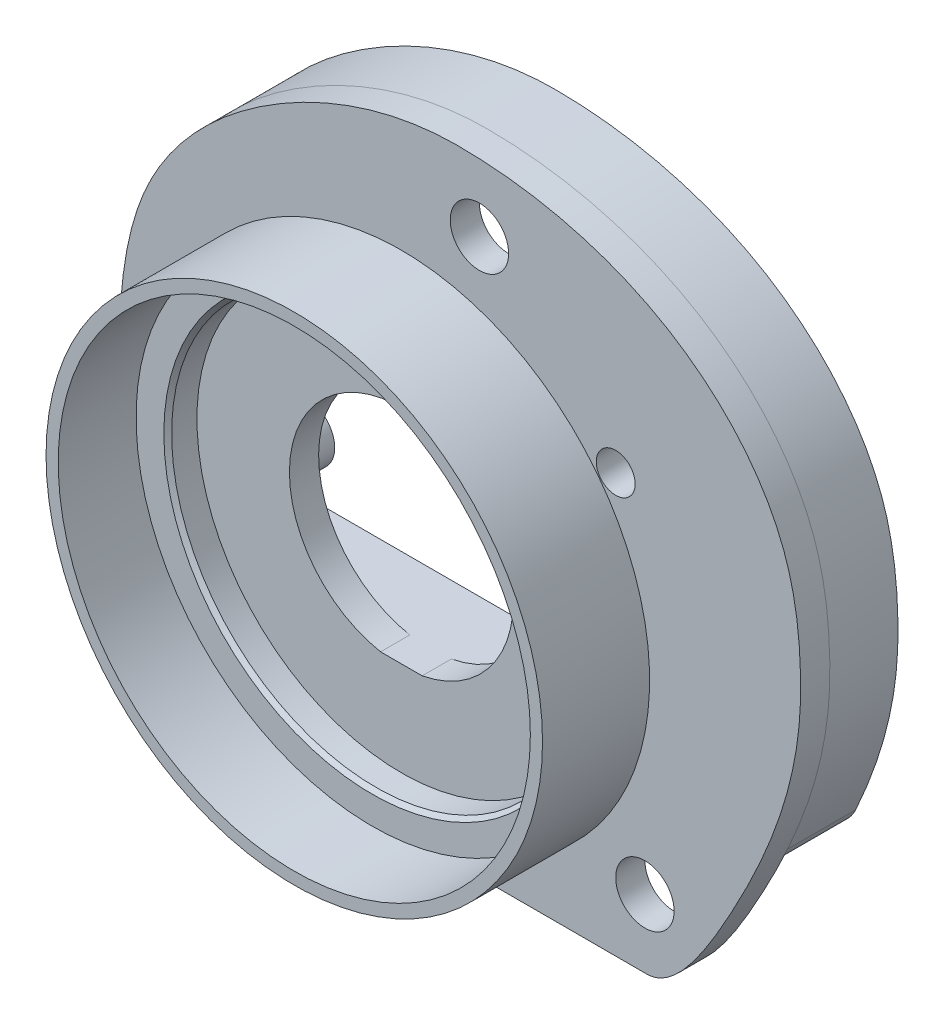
ISO-10303-21;
HEADER;
FILE_DESCRIPTION(('STEP AP214'),'2;1');
FILE_NAME('part.step','',(''),(''),'','','');
FILE_SCHEMA(('AUTOMOTIVE_DESIGN { 1 0 10303 214 1 1 1 1 }'));
ENDSEC;
DATA;
#1=APPLICATION_CONTEXT('core data for automotive mechanical design processes');
#2=APPLICATION_PROTOCOL_DEFINITION('international standard','automotive_design',2000,#1);
#3=PRODUCT_CONTEXT('',#1,'mechanical');
#4=PRODUCT('Part','Part','',(#3));
#5=PRODUCT_RELATED_PRODUCT_CATEGORY('part','',(#4));
#6=PRODUCT_DEFINITION_FORMATION('','',#4);
#7=PRODUCT_DEFINITION_CONTEXT('part definition',#1,'design');
#8=PRODUCT_DEFINITION('design','',#6,#7);
#9=PRODUCT_DEFINITION_SHAPE('','',#8);
#10=(LENGTH_UNIT() NAMED_UNIT(*) SI_UNIT(.MILLI.,.METRE.));
#11=(NAMED_UNIT(*) PLANE_ANGLE_UNIT() SI_UNIT($,.RADIAN.));
#12=(NAMED_UNIT(*) SI_UNIT($,.STERADIAN.) SOLID_ANGLE_UNIT());
#13=UNCERTAINTY_MEASURE_WITH_UNIT(LENGTH_MEASURE(1.E-05),#10,'distance_accuracy_value','');
#14=(GEOMETRIC_REPRESENTATION_CONTEXT(3) GLOBAL_UNCERTAINTY_ASSIGNED_CONTEXT((#13)) GLOBAL_UNIT_ASSIGNED_CONTEXT((#10,
#11,#12)) REPRESENTATION_CONTEXT('',''));
#15=CARTESIAN_POINT('',(0.,0.,0.));
#16=DIRECTION('',(0.,0.,1.));
#17=DIRECTION('',(1.,0.,0.));
#18=AXIS2_PLACEMENT_3D('',#15,#16,#17);
#19=CARTESIAN_POINT('',(31.5820135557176,13.1254710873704,-1.5));
#20=DIRECTION('',(0.,0.,-1.));
#21=DIRECTION('',(-1.,0.,0.));
#22=AXIS2_PLACEMENT_3D('',#19,#20,#21);
#23=PLANE('',#22);
#24=CARTESIAN_POINT('',(6.22831243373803,16.8240717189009,-1.5));
#25=DIRECTION('',(0.,0.,-1.));
#26=DIRECTION('',(-1.,0.,0.));
#27=AXIS2_PLACEMENT_3D('',#24,#25,#26);
#28=CIRCLE('',#27,1.5);
#29=CARTESIAN_POINT('',(4.72831243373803,16.8240717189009,-1.5));
#30=VERTEX_POINT('',#29);
#31=EDGE_CURVE('E166',#30,#30,#28,.T.);
#32=ORIENTED_EDGE('',*,*,#31,.F.);
#33=EDGE_LOOP('',(#32));
#34=FACE_BOUND('',#33,.T.);
#35=CARTESIAN_POINT('',(27.0866305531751,6.62407171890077,-1.5));
#36=DIRECTION('',(0.,0.,-1.));
#37=DIRECTION('',(-1.,0.,0.));
#38=AXIS2_PLACEMENT_3D('',#35,#36,#37);
#39=CIRCLE('',#38,1.5);
#40=CARTESIAN_POINT('',(25.5866305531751,6.62407171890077,-1.5));
#41=VERTEX_POINT('',#40);
#42=EDGE_CURVE('E178',#41,#41,#39,.T.);
#43=ORIENTED_EDGE('',*,*,#42,.F.);
#44=EDGE_LOOP('',(#43));
#45=FACE_BOUND('',#44,.T.);
#46=CARTESIAN_POINT('',(0.0708187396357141,6.62407171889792,-1.5));
#47=DIRECTION('',(0.,0.,-1.));
#48=DIRECTION('',(-1.,0.,0.));
#49=AXIS2_PLACEMENT_3D('',#46,#47,#48);
#50=CIRCLE('',#49,1.5);
#51=CARTESIAN_POINT('',(-1.42918126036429,6.62407171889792,-1.5));
#52=VERTEX_POINT('',#51);
#53=EDGE_CURVE('E190',#52,#52,#50,.T.);
#54=ORIENTED_EDGE('',*,*,#53,.F.);
#55=EDGE_LOOP('',(#54));
#56=FACE_BOUND('',#55,.T.);
#57=CARTESIAN_POINT('',(11.0942655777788,10.4740717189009,-1.5));
#58=DIRECTION('',(0.,0.,-1.));
#59=DIRECTION('',(-1.,0.,0.));
#60=AXIS2_PLACEMENT_3D('',#57,#58,#59);
#61=CIRCLE('',#60,5.75);
#62=CARTESIAN_POINT('',(10.0265577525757,4.82407171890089,-1.5));
#63=VERTEX_POINT('',#62);
#64=CARTESIAN_POINT('',(12.1619734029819,4.8240717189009,-1.5));
#65=VERTEX_POINT('',#64);
#66=EDGE_CURVE('E213',#63,#65,#61,.T.);
#67=ORIENTED_EDGE('',*,*,#66,.F.);
#68=DIRECTION('',(1.,0.,0.));
#69=VECTOR('',#68,1.);
#70=CARTESIAN_POINT('',(14.1039624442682,4.8240717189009,-1.5));
#71=LINE('',#70,#69);
#72=CARTESIAN_POINT('',(-0.534966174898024,4.82407171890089,-1.5));
#73=VERTEX_POINT('',#72);
#74=EDGE_CURVE('E471',#73,#63,#71,.T.);
#75=ORIENTED_EDGE('',*,*,#74,.F.);
#76=CARTESIAN_POINT('',(-0.534966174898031,5.82407171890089,-1.5));
#77=DIRECTION('',(0.,0.,1.));
#78=DIRECTION('',(1.,0.,0.));
#79=AXIS2_PLACEMENT_3D('',#76,#77,#78);
#80=CIRCLE('',#79,0.999999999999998);
#81=CARTESIAN_POINT('',(-1.49450825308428,5.54250645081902,-1.5));
#82=VERTEX_POINT('',#81);
#83=EDGE_CURVE('E482',#73,#82,#80,.F.);
#84=ORIENTED_EDGE('',*,*,#83,.T.);
#85=CARTESIAN_POINT('',(-1.49450825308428,5.54250645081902,-1.5));
#86=CARTESIAN_POINT('',(-1.5953175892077,5.88605308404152,-1.5));
#87=CARTESIAN_POINT('',(-1.78764288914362,6.58789998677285,-1.5));
#88=CARTESIAN_POINT('',(-2.09094383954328,7.91766389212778,-1.5));
#89=CARTESIAN_POINT('',(-2.34407765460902,9.54222727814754,-1.5));
#90=CARTESIAN_POINT('',(-2.42239712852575,11.5317924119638,-1.5));
#91=CARTESIAN_POINT('',(-2.32309957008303,14.3980351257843,-1.5));
#92=CARTESIAN_POINT('',(-1.78209325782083,17.8582865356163,-1.5));
#93=CARTESIAN_POINT('',(0.0646065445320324,21.3932267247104,-1.5));
#94=CARTESIAN_POINT('',(3.05839520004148,24.3711127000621,-1.5));
#95=CARTESIAN_POINT('',(6.73487663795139,26.675611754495,-1.5));
#96=CARTESIAN_POINT('',(10.0542104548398,27.878785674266,-1.5));
#97=CARTESIAN_POINT('',(12.737228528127,28.3169879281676,-1.5));
#98=CARTESIAN_POINT('',(15.4205692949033,28.3515467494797,-1.5));
#99=CARTESIAN_POINT('',(18.9649524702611,27.9246297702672,-1.5));
#100=CARTESIAN_POINT('',(22.9874672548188,26.5786026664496,-1.5));
#101=CARTESIAN_POINT('',(26.5229410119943,24.3049221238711,-1.5));
#102=CARTESIAN_POINT('',(28.7679292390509,21.6523952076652,-1.5));
#103=CARTESIAN_POINT('',(29.9190852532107,19.2118556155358,-1.5));
#104=CARTESIAN_POINT('',(30.4118310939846,17.2008095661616,-1.5));
#105=CARTESIAN_POINT('',(30.5763357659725,15.4436026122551,-1.5));
#106=CARTESIAN_POINT('',(30.6094587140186,14.1080941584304,-1.5));
#107=CARTESIAN_POINT('',(30.5749402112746,12.2446341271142,-1.5));
#108=CARTESIAN_POINT('',(30.2229204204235,10.0606266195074,-1.5));
#109=CARTESIAN_POINT('',(29.4965053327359,7.78614003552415,-1.5));
#110=CARTESIAN_POINT('',(28.9750160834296,6.44924835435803,-1.5));
#111=CARTESIAN_POINT('',(28.6718382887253,5.75144658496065,-1.5));
#112=CARTESIAN_POINT('',(28.5166633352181,5.41016498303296,-1.5));
#113=B_SPLINE_CURVE_WITH_KNOTS('',3,(#85,#86,#87,#88,#89,#90,#91,#92,#93,#94,#95,#96,#97,#98,
#99,#100,#101,#102,#103,#104,#105,#106,#107,#108,#109,#110,#111,#112),.UNSPECIFIED.,.F.,.F.,(4,
1,1,1,1,1,1,1,1,1,1,1,1,1,1,1,1,1,1,1,1,1,1,1,1,4),(0.941741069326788,0.951709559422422,
0.961678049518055,0.981615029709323,1.00155200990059,1.02148899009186,1.0613629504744,
1.10123691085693,1.14111087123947,1.180984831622,1.22085879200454,1.24079577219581,
1.26073275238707,1.30060671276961,1.34048067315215,1.38035463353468,1.42022859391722,
1.44016557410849,1.46010255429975,1.48003953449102,1.49000802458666,1.49997651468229,
1.53985047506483,1.55978745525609,1.56975594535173,1.57972443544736),.UNSPECIFIED.);
#114=CARTESIAN_POINT('',(28.5166633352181,5.41016498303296,-1.5));
#115=VERTEX_POINT('',#114);
#116=EDGE_CURVE('E506',#115,#82,#113,.F.);
#117=ORIENTED_EDGE('',*,*,#116,.F.);
#118=CARTESIAN_POINT('',(27.6063440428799,5.8240717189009,-1.5));
#119=DIRECTION('',(0.,0.,1.));
#120=DIRECTION('',(1.,0.,0.));
#121=AXIS2_PLACEMENT_3D('',#118,#119,#120);
#122=CIRCLE('',#121,1.);
#123=CARTESIAN_POINT('',(27.6063440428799,4.8240717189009,-1.5));
#124=VERTEX_POINT('',#123);
#125=EDGE_CURVE('E223',#115,#124,#122,.F.);
#126=ORIENTED_EDGE('',*,*,#125,.T.);
#127=EDGE_CURVE('E479',#65,#124,#71,.T.);
#128=ORIENTED_EDGE('',*,*,#127,.F.);
#129=EDGE_LOOP('',(#67,#75,#84,#117,#126,#128));
#130=FACE_BOUND('',#129,.T.);
#131=CARTESIAN_POINT('',(15.1028203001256,25.8240717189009,-1.5));
#132=DIRECTION('',(0.,0.,1.));
#133=DIRECTION('',(1.,0.,0.));
#134=AXIS2_PLACEMENT_3D('',#131,#132,#133);
#135=CIRCLE('',#134,1.5);
#136=CARTESIAN_POINT('',(16.6028203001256,25.8240717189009,-1.5));
#137=VERTEX_POINT('',#136);
#138=EDGE_CURVE('E328',#137,#137,#135,.T.);
#139=ORIENTED_EDGE('',*,*,#138,.T.);
#140=EDGE_LOOP('',(#139));
#141=FACE_BOUND('',#140,.T.);
#142=CARTESIAN_POINT('',(8.47380962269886,25.3240717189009,-1.5));
#143=DIRECTION('',(0.,0.,-1.));
#144=DIRECTION('',(-1.,0.,0.));
#145=AXIS2_PLACEMENT_3D('',#142,#143,#144);
#146=CIRCLE('',#145,1.5);
#147=CARTESIAN_POINT('',(6.97380962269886,25.3240717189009,-1.5));
#148=VERTEX_POINT('',#147);
#149=EDGE_CURVE('E184',#148,#148,#146,.T.);
#150=ORIENTED_EDGE('',*,*,#149,.F.);
#151=EDGE_LOOP('',(#150));
#152=FACE_BOUND('',#151,.T.);
#153=CARTESIAN_POINT('',(14.1655663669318,17.8240717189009,-1.5));
#154=DIRECTION('',(0.,0.,-1.));
#155=DIRECTION('',(-1.,0.,0.));
#156=AXIS2_PLACEMENT_3D('',#153,#154,#155);
#157=CIRCLE('',#156,1.5);
#158=CARTESIAN_POINT('',(12.6655663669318,17.8240717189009,-1.5));
#159=VERTEX_POINT('',#158);
#160=EDGE_CURVE('E172',#159,#159,#157,.T.);
#161=ORIENTED_EDGE('',*,*,#160,.F.);
#162=EDGE_LOOP('',(#161));
#163=FACE_BOUND('',#162,.T.);
#164=CARTESIAN_POINT('',(22.1028203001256,18.8240717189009,-1.5));
#165=DIRECTION('',(0.,0.,-1.));
#166=DIRECTION('',(-1.,0.,0.));
#167=AXIS2_PLACEMENT_3D('',#164,#165,#166);
#168=CIRCLE('',#167,2.3);
#169=CARTESIAN_POINT('',(21.0228203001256,20.8547366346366,-1.5));
#170=VERTEX_POINT('',#169);
#171=CARTESIAN_POINT('',(21.0228203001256,16.7934068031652,-1.5));
#172=VERTEX_POINT('',#171);
#173=EDGE_CURVE('E42',#170,#172,#168,.T.);
#174=ORIENTED_EDGE('',*,*,#173,.F.);
#175=DIRECTION('',(-0.386940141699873,0.922104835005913,0.));
#176=VECTOR('',#175,1.);
#177=CARTESIAN_POINT('',(21.5307594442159,19.6442828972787,-1.5));
#178=LINE('',#177,#176);
#179=CARTESIAN_POINT('',(21.5307594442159,19.6442828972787,-1.5));
#180=VERTEX_POINT('',#179);
#181=EDGE_CURVE('E139',#180,#170,#178,.T.);
#182=ORIENTED_EDGE('',*,*,#181,.F.);
#183=CARTESIAN_POINT('',(22.1028203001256,18.8240717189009,-1.5));
#184=DIRECTION('',(0.,0.,1.));
#185=DIRECTION('',(1.,0.,0.));
#186=AXIS2_PLACEMENT_3D('',#183,#184,#185);
#187=CIRCLE('',#186,1.);
#188=CARTESIAN_POINT('',(21.8806508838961,17.8490636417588,-1.5));
#189=VERTEX_POINT('',#188);
#190=EDGE_CURVE('E127',#180,#189,#187,.T.);
#191=ORIENTED_EDGE('',*,*,#190,.T.);
#192=DIRECTION('',(-0.630641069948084,-0.776074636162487,0.));
#193=VECTOR('',#192,1.);
#194=CARTESIAN_POINT('',(21.8806508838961,17.8490636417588,-1.5));
#195=LINE('',#194,#193);
#196=EDGE_CURVE('E47',#189,#172,#195,.T.);
#197=ORIENTED_EDGE('',*,*,#196,.T.);
#198=EDGE_LOOP('',(#174,#182,#191,#197));
#199=FACE_BOUND('',#198,.T.);
#200=ADVANCED_FACE('F26',(#34,#45,#56,#130,#141,#152,#163,#199),#23,.T.);
#201=CARTESIAN_POINT('',(6.22831243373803,16.8240717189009,-2.));
#202=DIRECTION('',(0.,0.,-1.));
#203=DIRECTION('',(-1.,0.,0.));
#204=AXIS2_PLACEMENT_3D('',#201,#202,#203);
#205=PLANE('',#204);
#206=CARTESIAN_POINT('',(6.22831243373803,16.8240717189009,-2.));
#207=DIRECTION('',(0.,0.,-1.));
#208=DIRECTION('',(-1.,0.,0.));
#209=AXIS2_PLACEMENT_3D('',#206,#207,#208);
#210=CIRCLE('',#209,1.5);
#211=CARTESIAN_POINT('',(4.72831243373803,16.8240717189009,-2.));
#212=VERTEX_POINT('',#211);
#213=EDGE_CURVE('E169',#212,#212,#210,.T.);
#214=ORIENTED_EDGE('',*,*,#213,.T.);
#215=EDGE_LOOP('',(#214));
#216=FACE_BOUND('',#215,.T.);
#217=CARTESIAN_POINT('',(6.22831243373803,16.8240717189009,-2.));
#218=DIRECTION('',(0.,0.,-1.));
#219=DIRECTION('',(-1.,0.,0.));
#220=AXIS2_PLACEMENT_3D('',#217,#218,#219);
#221=CIRCLE('',#220,0.85);
#222=CARTESIAN_POINT('',(5.37831243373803,16.8240717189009,-2.));
#223=VERTEX_POINT('',#222);
#224=EDGE_CURVE('E161',#223,#223,#221,.F.);
#225=ORIENTED_EDGE('',*,*,#224,.T.);
#226=EDGE_LOOP('',(#225));
#227=FACE_BOUND('',#226,.T.);
#228=ADVANCED_FACE('F288',(#216,#227),#205,.T.);
#229=CARTESIAN_POINT('',(14.1655663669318,17.8240717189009,-3.7));
#230=DIRECTION('',(0.,0.,-1.));
#231=DIRECTION('',(-1.,0.,0.));
#232=AXIS2_PLACEMENT_3D('',#229,#230,#231);
#233=PLANE('',#232);
#234=CARTESIAN_POINT('',(14.1655663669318,17.8240717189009,-3.7));
#235=DIRECTION('',(0.,0.,-1.));
#236=DIRECTION('',(-1.,0.,0.));
#237=AXIS2_PLACEMENT_3D('',#234,#235,#236);
#238=CIRCLE('',#237,1.5);
#239=CARTESIAN_POINT('',(12.6655663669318,17.8240717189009,-3.7));
#240=VERTEX_POINT('',#239);
#241=EDGE_CURVE('E175',#240,#240,#238,.T.);
#242=ORIENTED_EDGE('',*,*,#241,.T.);
#243=EDGE_LOOP('',(#242));
#244=FACE_BOUND('',#243,.T.);
#245=CARTESIAN_POINT('',(14.1655663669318,17.8240717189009,-3.7));
#246=DIRECTION('',(0.,0.,-1.));
#247=DIRECTION('',(-1.,0.,0.));
#248=AXIS2_PLACEMENT_3D('',#245,#246,#247);
#249=CIRCLE('',#248,0.85);
#250=CARTESIAN_POINT('',(13.3155663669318,17.8240717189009,-3.7));
#251=VERTEX_POINT('',#250);
#252=EDGE_CURVE('E165',#251,#251,#249,.F.);
#253=ORIENTED_EDGE('',*,*,#252,.T.);
#254=EDGE_LOOP('',(#253));
#255=FACE_BOUND('',#254,.T.);
#256=ADVANCED_FACE('F294',(#244,#255),#233,.T.);
#257=CARTESIAN_POINT('',(31.5820135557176,13.1254710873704,0.));
#258=DIRECTION('',(0.,0.,-1.));
#259=DIRECTION('',(-1.,0.,0.));
#260=AXIS2_PLACEMENT_3D('',#257,#258,#259);
#261=PLANE('',#260);
#262=CARTESIAN_POINT('',(23.6028203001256,0.824071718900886,0.));
#263=DIRECTION('',(0.,0.,1.));
#264=DIRECTION('',(1.,0.,0.));
#265=AXIS2_PLACEMENT_3D('',#262,#263,#264);
#266=CIRCLE('',#265,1.5);
#267=CARTESIAN_POINT('',(25.1028203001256,0.824071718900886,0.));
#268=VERTEX_POINT('',#267);
#269=EDGE_CURVE('E317',#268,#268,#266,.T.);
#270=ORIENTED_EDGE('',*,*,#269,.F.);
#271=EDGE_LOOP('',(#270));
#272=FACE_BOUND('',#271,.T.);
#273=CARTESIAN_POINT('',(22.1028203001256,18.8240717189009,0.));
#274=DIRECTION('',(0.,0.,1.));
#275=DIRECTION('',(1.,0.,0.));
#276=AXIS2_PLACEMENT_3D('',#273,#274,#275);
#277=CIRCLE('',#276,1.);
#278=CARTESIAN_POINT('',(23.1028203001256,18.8240717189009,0.));
#279=VERTEX_POINT('',#278);
#280=EDGE_CURVE('E136',#279,#279,#277,.T.);
#281=ORIENTED_EDGE('',*,*,#280,.F.);
#282=EDGE_LOOP('',(#281));
#283=FACE_BOUND('',#282,.T.);
#284=CARTESIAN_POINT('',(15.1028203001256,25.8240717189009,0.));
#285=DIRECTION('',(0.,0.,1.));
#286=DIRECTION('',(1.,0.,0.));
#287=AXIS2_PLACEMENT_3D('',#284,#285,#286);
#288=CIRCLE('',#287,1.5);
#289=CARTESIAN_POINT('',(16.6028203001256,25.8240717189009,0.));
#290=VERTEX_POINT('',#289);
#291=EDGE_CURVE('E135',#290,#290,#288,.T.);
#292=ORIENTED_EDGE('',*,*,#291,.F.);
#293=EDGE_LOOP('',(#292));
#294=FACE_BOUND('',#293,.T.);
#295=CARTESIAN_POINT('',(-3.39717969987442,11.3940717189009,0.));
#296=CARTESIAN_POINT('',(-3.3955130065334,8.68662854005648,0.));
#297=CARTESIAN_POINT('',(-2.37048036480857,4.0551062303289,0.));
#298=CARTESIAN_POINT('',(0.543552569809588,-2.67910524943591,0.));
#299=CARTESIAN_POINT('',(9.44137784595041,-2.66737217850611,0.));
#300=CARTESIAN_POINT('',(18.8489862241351,-2.6673721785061,0.));
#301=CARTESIAN_POINT('',(25.1310998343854,-2.67846884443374,0.));
#302=CARTESIAN_POINT('',(29.7261899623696,4.57031544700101,0.));
#303=CARTESIAN_POINT('',(31.6067218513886,10.1134498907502,0.));
#304=CARTESIAN_POINT('',(31.6012560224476,15.5639673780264,0.));
#305=CARTESIAN_POINT('',(31.2272704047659,20.572792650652,0.));
#306=CARTESIAN_POINT('',(25.2670084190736,27.6598455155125,0.));
#307=CARTESIAN_POINT('',(17.9103775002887,29.3286394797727,0.));
#308=CARTESIAN_POINT('',(10.6728633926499,29.3202436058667,0.));
#309=CARTESIAN_POINT('',(4.09944910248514,27.0823658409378,0.));
#310=CARTESIAN_POINT('',(-2.8292419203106,20.1806584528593,0.));
#311=CARTESIAN_POINT('',(-3.39879696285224,14.0212182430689,0.));
#312=CARTESIAN_POINT('',(-3.39717969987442,11.3940717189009,0.));
#313=B_SPLINE_CURVE_WITH_KNOTS('',3,(#295,#296,#297,#298,#299,#300,#301,#302,#303,#304,#305,
#306,#307,#308,#309,#310,#311,#312),.UNSPECIFIED.,.T.,.F.,(4,1,2,2,1,2,1,1,2,1,1,4),(0.,
0.0750955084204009,0.145707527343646,0.335877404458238,0.392344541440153,0.508788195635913,
0.555474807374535,0.636980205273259,0.746884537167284,0.838992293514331,0.927131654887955,1.),.UNSPECIFIED.);
#314=CARTESIAN_POINT('',(-3.39717969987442,11.3940717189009,0.));
#315=VERTEX_POINT('',#314);
#316=EDGE_CURVE('E331',#315,#315,#313,.T.);
#317=ORIENTED_EDGE('',*,*,#316,.T.);
#318=EDGE_LOOP('',(#317));
#319=FACE_BOUND('',#318,.T.);
#320=CARTESIAN_POINT('',(11.0942655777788,10.4740717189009,0.));
#321=DIRECTION('',(0.,0.,-1.));
#322=DIRECTION('',(-1.,0.,0.));
#323=AXIS2_PLACEMENT_3D('',#320,#321,#322);
#324=CIRCLE('',#323,12.75);
#325=CARTESIAN_POINT('',(-1.65573442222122,10.4740717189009,0.));
#326=VERTEX_POINT('',#325);
#327=EDGE_CURVE('E257',#326,#326,#324,.F.);
#328=ORIENTED_EDGE('',*,*,#327,.F.);
#329=EDGE_LOOP('',(#328));
#330=FACE_BOUND('',#329,.T.);
#331=ADVANCED_FACE('F309',(#272,#283,#294,#319,#330),#261,.F.);
#332=CARTESIAN_POINT('',(-3.39717969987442,11.3940717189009,-1.5));
#333=CARTESIAN_POINT('',(-3.3955130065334,8.68662854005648,-1.5));
#334=CARTESIAN_POINT('',(-2.37048036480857,4.0551062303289,-1.5));
#335=CARTESIAN_POINT('',(0.543552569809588,-2.67910524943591,-1.5));
#336=CARTESIAN_POINT('',(9.44137784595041,-2.66737217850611,-1.5));
#337=CARTESIAN_POINT('',(18.8489862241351,-2.6673721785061,-1.5));
#338=CARTESIAN_POINT('',(25.1310998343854,-2.67846884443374,-1.5));
#339=CARTESIAN_POINT('',(29.7261899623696,4.57031544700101,-1.5));
#340=CARTESIAN_POINT('',(31.6067218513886,10.1134498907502,-1.5));
#341=CARTESIAN_POINT('',(31.6012560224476,15.5639673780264,-1.5));
#342=CARTESIAN_POINT('',(31.2272704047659,20.572792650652,-1.5));
#343=CARTESIAN_POINT('',(25.2670084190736,27.6598455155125,-1.5));
#344=CARTESIAN_POINT('',(17.9103775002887,29.3286394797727,-1.5));
#345=CARTESIAN_POINT('',(10.6728633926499,29.3202436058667,-1.5));
#346=CARTESIAN_POINT('',(4.09944910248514,27.0823658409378,-1.5));
#347=CARTESIAN_POINT('',(-2.8292419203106,20.1806584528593,-1.5));
#348=CARTESIAN_POINT('',(-3.39879696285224,14.0212182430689,-1.5));
#349=CARTESIAN_POINT('',(-3.39717969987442,11.3940717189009,-1.5));
#350=B_SPLINE_CURVE_WITH_KNOTS('',3,(#332,#333,#334,#335,#336,#337,#338,#339,#340,#341,#342,
#343,#344,#345,#346,#347,#348,#349),.UNSPECIFIED.,.T.,.F.,(4,1,2,2,1,2,1,1,2,1,1,4),(0.,
0.0750955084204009,0.145707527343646,0.335877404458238,0.392344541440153,0.508788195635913,
0.555474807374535,0.636980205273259,0.746884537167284,0.838992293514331,0.927131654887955,1.),.UNSPECIFIED.);
#351=DIRECTION('',(0.,0.,1.));
#352=VECTOR('',#351,1.);
#353=SURFACE_OF_LINEAR_EXTRUSION('',#350,#352);
#354=CARTESIAN_POINT('',(-2.45405033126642,5.26094118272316,-1.5));
#355=VERTEX_POINT('',#354);
#356=CARTESIAN_POINT('',(29.4269826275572,4.99625824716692,-1.5));
#357=VERTEX_POINT('',#356);
#358=EDGE_CURVE('E230',#355,#357,#350,.T.);
#359=ORIENTED_EDGE('',*,*,#358,.T.);
#360=CARTESIAN_POINT('',(-3.39717969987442,11.3940717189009,-1.5));
#361=CARTESIAN_POINT('',(-3.3955130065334,8.68662854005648,-1.5));
#362=CARTESIAN_POINT('',(-2.37048036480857,4.0551062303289,-1.5));
#363=CARTESIAN_POINT('',(0.543552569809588,-2.67910524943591,-1.5));
#364=CARTESIAN_POINT('',(9.44137784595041,-2.66737217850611,-1.5));
#365=CARTESIAN_POINT('',(18.8489862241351,-2.6673721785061,-1.5));
#366=CARTESIAN_POINT('',(25.1310998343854,-2.67846884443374,-1.5));
#367=CARTESIAN_POINT('',(29.7261899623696,4.57031544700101,-1.5));
#368=CARTESIAN_POINT('',(31.6067218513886,10.1134498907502,-1.5));
#369=CARTESIAN_POINT('',(31.6012560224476,15.5639673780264,-1.5));
#370=CARTESIAN_POINT('',(31.2272704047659,20.572792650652,-1.5));
#371=CARTESIAN_POINT('',(25.2670084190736,27.6598455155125,-1.5));
#372=CARTESIAN_POINT('',(17.9103775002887,29.3286394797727,-1.5));
#373=CARTESIAN_POINT('',(10.6728633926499,29.3202436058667,-1.5));
#374=CARTESIAN_POINT('',(4.09944910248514,27.0823658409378,-1.5));
#375=CARTESIAN_POINT('',(-2.8292419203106,20.1806584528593,-1.5));
#376=CARTESIAN_POINT('',(-3.39879696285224,14.0212182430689,-1.5));
#377=CARTESIAN_POINT('',(-3.39717969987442,11.3940717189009,-1.5));
#378=B_SPLINE_CURVE_WITH_KNOTS('',3,(#360,#361,#362,#363,#364,#365,#366,#367,#368,#369,#370,
#371,#372,#373,#374,#375,#376,#377),.UNSPECIFIED.,.T.,.F.,(4,1,2,2,1,2,1,1,2,1,1,4),(0.,
0.0750955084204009,0.145707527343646,0.335877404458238,0.392344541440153,0.508788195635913,
0.555474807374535,0.636980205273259,0.746884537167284,0.838992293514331,0.927131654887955,1.),.UNSPECIFIED.);
#379=EDGE_CURVE('E229',#355,#357,#378,.F.);
#380=ORIENTED_EDGE('',*,*,#379,.F.);
#381=EDGE_LOOP('',(#359,#380));
#382=FACE_BOUND('',#381,.T.);
#383=ORIENTED_EDGE('',*,*,#316,.F.);
#384=EDGE_LOOP('',(#383));
#385=FACE_BOUND('',#384,.T.);
#386=ADVANCED_FACE('F28',(#382,#385),#353,.T.);
#387=CARTESIAN_POINT('',(27.6063440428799,5.8240717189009,-1.5));
#388=DIRECTION('',(0.,0.,1.));
#389=DIRECTION('',(1.,0.,0.));
#390=AXIS2_PLACEMENT_3D('',#387,#388,#389);
#391=CIRCLE('',#390,2.);
#392=CARTESIAN_POINT('',(27.6063440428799,3.82407171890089,-1.5));
#393=VERTEX_POINT('',#392);
#394=EDGE_CURVE('E240',#357,#393,#391,.F.);
#395=ORIENTED_EDGE('',*,*,#394,.F.);
#396=ORIENTED_EDGE('',*,*,#358,.F.);
#397=CARTESIAN_POINT('',(-0.534966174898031,5.82407171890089,-1.5));
#398=DIRECTION('',(0.,0.,1.));
#399=DIRECTION('',(1.,0.,0.));
#400=AXIS2_PLACEMENT_3D('',#397,#398,#399);
#401=CIRCLE('',#400,2.);
#402=CARTESIAN_POINT('',(-0.534966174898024,3.82407171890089,-1.5));
#403=VERTEX_POINT('',#402);
#404=EDGE_CURVE('E220',#403,#355,#401,.F.);
#405=ORIENTED_EDGE('',*,*,#404,.F.);
#406=DIRECTION('',(1.,0.,0.));
#407=VECTOR('',#406,1.);
#408=CARTESIAN_POINT('',(14.1039624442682,3.82407171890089,-1.5));
#409=LINE('',#408,#407);
#410=EDGE_CURVE('E218',#403,#393,#409,.T.);
#411=ORIENTED_EDGE('',*,*,#410,.T.);
#412=EDGE_LOOP('',(#395,#396,#405,#411));
#413=FACE_BOUND('',#412,.T.);
#414=CARTESIAN_POINT('',(23.6028203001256,0.824071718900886,-1.5));
#415=DIRECTION('',(0.,0.,1.));
#416=DIRECTION('',(1.,0.,0.));
#417=AXIS2_PLACEMENT_3D('',#414,#415,#416);
#418=CIRCLE('',#417,1.5);
#419=CARTESIAN_POINT('',(25.1028203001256,0.824071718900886,-1.5));
#420=VERTEX_POINT('',#419);
#421=EDGE_CURVE('E315',#420,#420,#418,.T.);
#422=ORIENTED_EDGE('',*,*,#421,.T.);
#423=EDGE_LOOP('',(#422));
#424=FACE_BOUND('',#423,.T.);
#425=ADVANCED_FACE('F290',(#413,#424),#23,.T.);
#426=CARTESIAN_POINT('',(11.0942655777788,10.4740717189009,0.));
#427=DIRECTION('',(0.,0.,1.));
#428=DIRECTION('',(1.,0.,0.));
#429=AXIS2_PLACEMENT_3D('',#426,#427,#428);
#430=CIRCLE('',#429,10.5);
#431=CARTESIAN_POINT('',(21.5942655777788,10.4740717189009,0.));
#432=VERTEX_POINT('',#431);
#433=EDGE_CURVE('E202',#432,#432,#430,.T.);
#434=ORIENTED_EDGE('',*,*,#433,.T.);
#435=EDGE_LOOP('',(#434));
#436=FACE_BOUND('',#435,.T.);
#437=DIRECTION('',(1.,0.,0.));
#438=VECTOR('',#437,1.);
#439=CARTESIAN_POINT('',(12.1619734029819,4.8240717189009,0.));
#440=LINE('',#439,#438);
#441=CARTESIAN_POINT('',(10.0265577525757,4.8240717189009,0.));
#442=VERTEX_POINT('',#441);
#443=CARTESIAN_POINT('',(12.1619734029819,4.8240717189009,0.));
#444=VERTEX_POINT('',#443);
#445=EDGE_CURVE('E207',#442,#444,#440,.T.);
#446=ORIENTED_EDGE('',*,*,#445,.F.);
#447=CARTESIAN_POINT('',(11.0942655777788,10.4740717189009,0.));
#448=DIRECTION('',(0.,0.,1.));
#449=DIRECTION('',(1.,0.,0.));
#450=AXIS2_PLACEMENT_3D('',#447,#448,#449);
#451=CIRCLE('',#450,5.75);
#452=EDGE_CURVE('E205',#444,#442,#451,.T.);
#453=ORIENTED_EDGE('',*,*,#452,.F.);
#454=EDGE_LOOP('',(#446,#453));
#455=FACE_BOUND('',#454,.T.);
#456=ADVANCED_FACE('F301',(#436,#455),#261,.F.);
#457=CARTESIAN_POINT('',(15.1028203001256,25.8240717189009,-1.5));
#458=DIRECTION('',(0.,0.,1.));
#459=DIRECTION('',(1.,0.,0.));
#460=AXIS2_PLACEMENT_3D('',#457,#458,#459);
#461=CYLINDRICAL_SURFACE('',#460,1.5);
#462=ORIENTED_EDGE('',*,*,#138,.F.);
#463=EDGE_LOOP('',(#462));
#464=FACE_BOUND('',#463,.T.);
#465=ORIENTED_EDGE('',*,*,#291,.T.);
#466=EDGE_LOOP('',(#465));
#467=FACE_BOUND('',#466,.T.);
#468=ADVANCED_FACE('F307',(#464,#467),#461,.F.);
#469=CARTESIAN_POINT('',(22.1028203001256,18.8240717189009,-1.5));
#470=DIRECTION('',(0.,0.,1.));
#471=DIRECTION('',(1.,0.,0.));
#472=AXIS2_PLACEMENT_3D('',#469,#470,#471);
#473=CYLINDRICAL_SURFACE('',#472,1.);
#474=ORIENTED_EDGE('',*,*,#190,.F.);
#475=DIRECTION('',(0.,0.,1.));
#476=VECTOR('',#475,1.);
#477=CARTESIAN_POINT('',(21.5307594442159,19.6442828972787,-5.5));
#478=LINE('',#477,#476);
#479=CARTESIAN_POINT('',(21.5307594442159,19.6442828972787,-5.5));
#480=VERTEX_POINT('',#479);
#481=EDGE_CURVE('E132',#480,#180,#478,.T.);
#482=ORIENTED_EDGE('',*,*,#481,.F.);
#483=CARTESIAN_POINT('',(22.1028203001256,18.8240717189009,-5.5));
#484=DIRECTION('',(0.,0.,-1.));
#485=DIRECTION('',(-1.,0.,0.));
#486=AXIS2_PLACEMENT_3D('',#483,#484,#485);
#487=CIRCLE('',#486,1.);
#488=CARTESIAN_POINT('',(21.8806508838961,17.8490636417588,-5.5));
#489=VERTEX_POINT('',#488);
#490=EDGE_CURVE('E147',#480,#489,#487,.T.);
#491=ORIENTED_EDGE('',*,*,#490,.T.);
#492=DIRECTION('',(0.,0.,1.));
#493=VECTOR('',#492,1.);
#494=CARTESIAN_POINT('',(21.8806508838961,17.8490636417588,-5.5));
#495=LINE('',#494,#493);
#496=EDGE_CURVE('E134',#489,#189,#495,.T.);
#497=ORIENTED_EDGE('',*,*,#496,.T.);
#498=EDGE_LOOP('',(#474,#482,#491,#497));
#499=FACE_BOUND('',#498,.T.);
#500=ORIENTED_EDGE('',*,*,#280,.T.);
#501=EDGE_LOOP('',(#500));
#502=FACE_BOUND('',#501,.T.);
#503=ADVANCED_FACE('F128',(#499,#502),#473,.F.);
#504=CARTESIAN_POINT('',(23.6028203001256,0.824071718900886,-1.5));
#505=DIRECTION('',(0.,0.,1.));
#506=DIRECTION('',(1.,0.,0.));
#507=AXIS2_PLACEMENT_3D('',#504,#505,#506);
#508=CYLINDRICAL_SURFACE('',#507,1.5);
#509=ORIENTED_EDGE('',*,*,#421,.F.);
#510=EDGE_LOOP('',(#509));
#511=FACE_BOUND('',#510,.T.);
#512=ORIENTED_EDGE('',*,*,#269,.T.);
#513=EDGE_LOOP('',(#512));
#514=FACE_BOUND('',#513,.T.);
#515=ADVANCED_FACE('F396',(#511,#514),#508,.F.);
#516=CARTESIAN_POINT('',(27.6063440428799,5.8240717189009,-5.));
#517=DIRECTION('',(0.,0.,1.));
#518=DIRECTION('',(1.,0.,0.));
#519=AXIS2_PLACEMENT_3D('',#516,#517,#518);
#520=CYLINDRICAL_SURFACE('',#519,1.);
#521=ORIENTED_EDGE('',*,*,#125,.F.);
#522=DIRECTION('',(0.,0.,1.));
#523=VECTOR('',#522,1.);
#524=CARTESIAN_POINT('',(28.5166633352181,5.41016498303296,-5.));
#525=LINE('',#524,#523);
#526=CARTESIAN_POINT('',(28.5166633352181,5.41016498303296,-5.));
#527=VERTEX_POINT('',#526);
#528=EDGE_CURVE('E322',#527,#115,#525,.T.);
#529=ORIENTED_EDGE('',*,*,#528,.F.);
#530=CARTESIAN_POINT('',(27.6063440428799,5.8240717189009,-5.));
#531=DIRECTION('',(0.,0.,1.));
#532=DIRECTION('',(1.,0.,0.));
#533=AXIS2_PLACEMENT_3D('',#530,#531,#532);
#534=CIRCLE('',#533,1.);
#535=CARTESIAN_POINT('',(27.6063440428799,4.8240717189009,-5.));
#536=VERTEX_POINT('',#535);
#537=EDGE_CURVE('E363',#527,#536,#534,.F.);
#538=ORIENTED_EDGE('',*,*,#537,.T.);
#539=DIRECTION('',(0.,0.,1.));
#540=VECTOR('',#539,1.);
#541=CARTESIAN_POINT('',(27.6063440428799,4.8240717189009,-5.));
#542=LINE('',#541,#540);
#543=EDGE_CURVE('E492',#536,#124,#542,.T.);
#544=ORIENTED_EDGE('',*,*,#543,.T.);
#545=EDGE_LOOP('',(#521,#529,#538,#544));
#546=FACE_BOUND('',#545,.T.);
#547=ADVANCED_FACE('F391',(#546),#520,.F.);
#548=CARTESIAN_POINT('',(-1.49450825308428,5.54250645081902,-5.));
#549=CARTESIAN_POINT('',(-1.5953175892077,5.88605308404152,-5.));
#550=CARTESIAN_POINT('',(-1.78764288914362,6.58789998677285,-5.));
#551=CARTESIAN_POINT('',(-2.09094383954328,7.91766389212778,-5.));
#552=CARTESIAN_POINT('',(-2.34407765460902,9.54222727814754,-5.));
#553=CARTESIAN_POINT('',(-2.42239712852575,11.5317924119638,-5.));
#554=CARTESIAN_POINT('',(-2.32309957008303,14.3980351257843,-5.));
#555=CARTESIAN_POINT('',(-1.78209325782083,17.8582865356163,-5.));
#556=CARTESIAN_POINT('',(0.0646065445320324,21.3932267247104,-5.));
#557=CARTESIAN_POINT('',(3.05839520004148,24.3711127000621,-5.));
#558=CARTESIAN_POINT('',(6.73487663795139,26.675611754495,-5.));
#559=CARTESIAN_POINT('',(10.0542104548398,27.878785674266,-5.));
#560=CARTESIAN_POINT('',(12.737228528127,28.3169879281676,-5.));
#561=CARTESIAN_POINT('',(15.4205692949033,28.3515467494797,-5.));
#562=CARTESIAN_POINT('',(18.9649524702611,27.9246297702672,-5.));
#563=CARTESIAN_POINT('',(22.9874672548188,26.5786026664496,-5.));
#564=CARTESIAN_POINT('',(26.5229410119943,24.3049221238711,-5.));
#565=CARTESIAN_POINT('',(28.7679292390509,21.6523952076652,-5.));
#566=CARTESIAN_POINT('',(29.9190852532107,19.2118556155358,-5.));
#567=CARTESIAN_POINT('',(30.4118310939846,17.2008095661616,-5.));
#568=CARTESIAN_POINT('',(30.5763357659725,15.4436026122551,-5.));
#569=CARTESIAN_POINT('',(30.6094587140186,14.1080941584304,-5.));
#570=CARTESIAN_POINT('',(30.5749402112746,12.2446341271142,-5.));
#571=CARTESIAN_POINT('',(30.2229204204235,10.0606266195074,-5.));
#572=CARTESIAN_POINT('',(29.4965053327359,7.78614003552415,-5.));
#573=CARTESIAN_POINT('',(28.9750160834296,6.44924835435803,-5.));
#574=CARTESIAN_POINT('',(28.6718382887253,5.75144658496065,-5.));
#575=CARTESIAN_POINT('',(28.5166633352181,5.41016498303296,-5.));
#576=B_SPLINE_CURVE_WITH_KNOTS('',3,(#548,#549,#550,#551,#552,#553,#554,#555,#556,#557,#558,
#559,#560,#561,#562,#563,#564,#565,#566,#567,#568,#569,#570,#571,#572,#573,#574,#575),
.UNSPECIFIED.,.F.,.F.,(4,1,1,1,1,1,1,1,1,1,1,1,1,1,1,1,1,1,1,1,1,1,1,1,1,4),(0.941741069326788,
0.951709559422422,0.961678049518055,0.981615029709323,1.00155200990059,1.02148899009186,
1.0613629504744,1.10123691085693,1.14111087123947,1.180984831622,1.22085879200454,
1.24079577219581,1.26073275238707,1.30060671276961,1.34048067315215,1.38035463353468,
1.42022859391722,1.44016557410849,1.46010255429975,1.48003953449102,1.49000802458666,
1.49997651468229,1.53985047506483,1.55978745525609,1.56975594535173,1.57972443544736),.UNSPECIFIED.);
#577=DIRECTION('',(0.,0.,1.));
#578=VECTOR('',#577,1.);
#579=SURFACE_OF_LINEAR_EXTRUSION('',#576,#578);
#580=ORIENTED_EDGE('',*,*,#116,.T.);
#581=DIRECTION('',(0.,0.,1.));
#582=VECTOR('',#581,1.);
#583=CARTESIAN_POINT('',(-1.49450825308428,5.54250645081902,-5.));
#584=LINE('',#583,#582);
#585=CARTESIAN_POINT('',(-1.49450825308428,5.54250645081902,-5.));
#586=VERTEX_POINT('',#585);
#587=EDGE_CURVE('E497',#586,#82,#584,.T.);
#588=ORIENTED_EDGE('',*,*,#587,.F.);
#589=EDGE_CURVE('E367',#527,#586,#576,.F.);
#590=ORIENTED_EDGE('',*,*,#589,.F.);
#591=ORIENTED_EDGE('',*,*,#528,.T.);
#592=EDGE_LOOP('',(#580,#588,#590,#591));
#593=FACE_BOUND('',#592,.T.);
#594=ADVANCED_FACE('F386',(#593),#579,.T.);
#595=CARTESIAN_POINT('',(-0.534966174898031,5.82407171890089,-5.));
#596=DIRECTION('',(0.,0.,1.));
#597=DIRECTION('',(1.,0.,0.));
#598=AXIS2_PLACEMENT_3D('',#595,#596,#597);
#599=CYLINDRICAL_SURFACE('',#598,0.999999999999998);
#600=ORIENTED_EDGE('',*,*,#83,.F.);
#601=DIRECTION('',(0.,0.,1.));
#602=VECTOR('',#601,1.);
#603=CARTESIAN_POINT('',(-0.534966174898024,4.82407171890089,-5.));
#604=LINE('',#603,#602);
#605=CARTESIAN_POINT('',(-0.534966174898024,4.82407171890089,-5.));
#606=VERTEX_POINT('',#605);
#607=EDGE_CURVE('E474',#606,#73,#604,.T.);
#608=ORIENTED_EDGE('',*,*,#607,.F.);
#609=CARTESIAN_POINT('',(-0.534966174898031,5.82407171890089,-5.));
#610=DIRECTION('',(0.,0.,1.));
#611=DIRECTION('',(1.,0.,0.));
#612=AXIS2_PLACEMENT_3D('',#609,#610,#611);
#613=CIRCLE('',#612,0.999999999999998);
#614=EDGE_CURVE('E380',#606,#586,#613,.F.);
#615=ORIENTED_EDGE('',*,*,#614,.T.);
#616=ORIENTED_EDGE('',*,*,#587,.T.);
#617=EDGE_LOOP('',(#600,#608,#615,#616));
#618=FACE_BOUND('',#617,.T.);
#619=ADVANCED_FACE('F390',(#618),#599,.F.);
#620=CARTESIAN_POINT('',(14.1039624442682,3.82407171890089,-5.));
#621=DIRECTION('',(0.,-1.,0.));
#622=DIRECTION('',(1.,0.,0.));
#623=AXIS2_PLACEMENT_3D('',#620,#621,#622);
#624=PLANE('',#623);
#625=ORIENTED_EDGE('',*,*,#410,.F.);
#626=DIRECTION('',(0.,0.,1.));
#627=VECTOR('',#626,1.);
#628=CARTESIAN_POINT('',(-0.534966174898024,3.82407171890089,-5.));
#629=LINE('',#628,#627);
#630=CARTESIAN_POINT('',(-0.534966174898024,3.82407171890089,-5.));
#631=VERTEX_POINT('',#630);
#632=EDGE_CURVE('E234',#631,#403,#629,.T.);
#633=ORIENTED_EDGE('',*,*,#632,.F.);
#634=DIRECTION('',(1.,0.,0.));
#635=VECTOR('',#634,1.);
#636=CARTESIAN_POINT('',(14.1039624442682,3.82407171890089,-5.));
#637=LINE('',#636,#635);
#638=CARTESIAN_POINT('',(27.6063440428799,3.82407171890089,-5.));
#639=VERTEX_POINT('',#638);
#640=EDGE_CURVE('E478',#631,#639,#637,.T.);
#641=ORIENTED_EDGE('',*,*,#640,.T.);
#642=DIRECTION('',(0.,0.,1.));
#643=VECTOR('',#642,1.);
#644=CARTESIAN_POINT('',(27.6063440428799,3.82407171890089,-5.));
#645=LINE('',#644,#643);
#646=EDGE_CURVE('E254',#639,#393,#645,.T.);
#647=ORIENTED_EDGE('',*,*,#646,.T.);
#648=EDGE_LOOP('',(#625,#633,#641,#647));
#649=FACE_BOUND('',#648,.T.);
#650=ADVANCED_FACE('F406',(#649),#624,.T.);
#651=CARTESIAN_POINT('',(-0.534966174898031,5.82407171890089,-5.));
#652=DIRECTION('',(0.,0.,1.));
#653=DIRECTION('',(1.,0.,0.));
#654=AXIS2_PLACEMENT_3D('',#651,#652,#653);
#655=CYLINDRICAL_SURFACE('',#654,2.);
#656=ORIENTED_EDGE('',*,*,#404,.T.);
#657=DIRECTION('',(0.,0.,1.));
#658=VECTOR('',#657,1.);
#659=CARTESIAN_POINT('',(-2.45405033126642,5.26094118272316,-5.));
#660=LINE('',#659,#658);
#661=CARTESIAN_POINT('',(-2.45405033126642,5.26094118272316,-5.));
#662=VERTEX_POINT('',#661);
#663=EDGE_CURVE('E231',#662,#355,#660,.T.);
#664=ORIENTED_EDGE('',*,*,#663,.F.);
#665=CARTESIAN_POINT('',(-0.534966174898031,5.82407171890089,-5.));
#666=DIRECTION('',(0.,0.,1.));
#667=DIRECTION('',(1.,0.,0.));
#668=AXIS2_PLACEMENT_3D('',#665,#666,#667);
#669=CIRCLE('',#668,2.);
#670=EDGE_CURVE('E369',#631,#662,#669,.F.);
#671=ORIENTED_EDGE('',*,*,#670,.F.);
#672=ORIENTED_EDGE('',*,*,#632,.T.);
#673=EDGE_LOOP('',(#656,#664,#671,#672));
#674=FACE_BOUND('',#673,.T.);
#675=ADVANCED_FACE('F403',(#674),#655,.T.);
#676=CARTESIAN_POINT('',(-3.39717969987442,11.3940717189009,-5.));
#677=CARTESIAN_POINT('',(-3.3955130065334,8.68662854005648,-5.));
#678=CARTESIAN_POINT('',(-2.37048036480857,4.0551062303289,-5.));
#679=CARTESIAN_POINT('',(0.543552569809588,-2.67910524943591,-5.));
#680=CARTESIAN_POINT('',(9.44137784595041,-2.66737217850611,-5.));
#681=CARTESIAN_POINT('',(18.8489862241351,-2.6673721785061,-5.));
#682=CARTESIAN_POINT('',(25.1310998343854,-2.67846884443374,-5.));
#683=CARTESIAN_POINT('',(29.7261899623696,4.57031544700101,-5.));
#684=CARTESIAN_POINT('',(31.6067218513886,10.1134498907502,-5.));
#685=CARTESIAN_POINT('',(31.6012560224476,15.5639673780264,-5.));
#686=CARTESIAN_POINT('',(31.2272704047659,20.572792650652,-5.));
#687=CARTESIAN_POINT('',(25.2670084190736,27.6598455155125,-5.));
#688=CARTESIAN_POINT('',(17.9103775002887,29.3286394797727,-5.));
#689=CARTESIAN_POINT('',(10.6728633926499,29.3202436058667,-5.));
#690=CARTESIAN_POINT('',(4.09944910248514,27.0823658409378,-5.));
#691=CARTESIAN_POINT('',(-2.8292419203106,20.1806584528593,-5.));
#692=CARTESIAN_POINT('',(-3.39879696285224,14.0212182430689,-5.));
#693=CARTESIAN_POINT('',(-3.39717969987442,11.3940717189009,-5.));
#694=B_SPLINE_CURVE_WITH_KNOTS('',3,(#676,#677,#678,#679,#680,#681,#682,#683,#684,#685,#686,
#687,#688,#689,#690,#691,#692,#693),.UNSPECIFIED.,.T.,.F.,(4,1,2,2,1,2,1,1,2,1,1,4),(0.,
0.0750955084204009,0.145707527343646,0.335877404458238,0.392344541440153,0.508788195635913,
0.555474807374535,0.636980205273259,0.746884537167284,0.838992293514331,0.927131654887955,1.),.UNSPECIFIED.);
#695=DIRECTION('',(0.,0.,1.));
#696=VECTOR('',#695,1.);
#697=SURFACE_OF_LINEAR_EXTRUSION('',#694,#696);
#698=ORIENTED_EDGE('',*,*,#379,.T.);
#699=DIRECTION('',(0.,0.,1.));
#700=VECTOR('',#699,1.);
#701=CARTESIAN_POINT('',(29.4269826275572,4.99625824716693,-5.));
#702=LINE('',#701,#700);
#703=CARTESIAN_POINT('',(29.4269826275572,4.99625824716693,-5.));
#704=VERTEX_POINT('',#703);
#705=EDGE_CURVE('E235',#704,#357,#702,.T.);
#706=ORIENTED_EDGE('',*,*,#705,.F.);
#707=EDGE_CURVE('E364',#662,#704,#694,.F.);
#708=ORIENTED_EDGE('',*,*,#707,.F.);
#709=ORIENTED_EDGE('',*,*,#663,.T.);
#710=EDGE_LOOP('',(#698,#706,#708,#709));
#711=FACE_BOUND('',#710,.T.);
#712=ADVANCED_FACE('F351',(#711),#697,.T.);
#713=CARTESIAN_POINT('',(27.6063440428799,5.8240717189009,-5.));
#714=DIRECTION('',(0.,0.,1.));
#715=DIRECTION('',(1.,0.,0.));
#716=AXIS2_PLACEMENT_3D('',#713,#714,#715);
#717=CYLINDRICAL_SURFACE('',#716,2.);
#718=ORIENTED_EDGE('',*,*,#394,.T.);
#719=ORIENTED_EDGE('',*,*,#646,.F.);
#720=CARTESIAN_POINT('',(27.6063440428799,5.8240717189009,-5.));
#721=DIRECTION('',(0.,0.,1.));
#722=DIRECTION('',(1.,0.,0.));
#723=AXIS2_PLACEMENT_3D('',#720,#721,#722);
#724=CIRCLE('',#723,2.);
#725=EDGE_CURVE('E358',#704,#639,#724,.F.);
#726=ORIENTED_EDGE('',*,*,#725,.F.);
#727=ORIENTED_EDGE('',*,*,#705,.T.);
#728=EDGE_LOOP('',(#718,#719,#726,#727));
#729=FACE_BOUND('',#728,.T.);
#730=ADVANCED_FACE('F356',(#729),#717,.T.);
#731=CARTESIAN_POINT('',(14.1039624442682,4.8240717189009,-5.));
#732=DIRECTION('',(0.,-1.,0.));
#733=DIRECTION('',(1.,0.,0.));
#734=AXIS2_PLACEMENT_3D('',#731,#732,#733);
#735=PLANE('',#734);
#736=ORIENTED_EDGE('',*,*,#74,.T.);
#737=DIRECTION('',(0.,0.,1.));
#738=VECTOR('',#737,1.);
#739=CARTESIAN_POINT('',(10.0265577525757,4.82407171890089,-3.5));
#740=LINE('',#739,#738);
#741=EDGE_CURVE('E210',#63,#442,#740,.T.);
#742=ORIENTED_EDGE('',*,*,#741,.T.);
#743=ORIENTED_EDGE('',*,*,#445,.T.);
#744=DIRECTION('',(0.,0.,1.));
#745=VECTOR('',#744,1.);
#746=CARTESIAN_POINT('',(12.1619734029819,4.8240717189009,-3.5));
#747=LINE('',#746,#745);
#748=EDGE_CURVE('E211',#65,#444,#747,.T.);
#749=ORIENTED_EDGE('',*,*,#748,.F.);
#750=ORIENTED_EDGE('',*,*,#127,.T.);
#751=ORIENTED_EDGE('',*,*,#543,.F.);
#752=DIRECTION('',(1.,0.,0.));
#753=VECTOR('',#752,1.);
#754=CARTESIAN_POINT('',(14.1039624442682,4.8240717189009,-5.));
#755=LINE('',#754,#753);
#756=EDGE_CURVE('E488',#606,#536,#755,.T.);
#757=ORIENTED_EDGE('',*,*,#756,.F.);
#758=ORIENTED_EDGE('',*,*,#607,.T.);
#759=EDGE_LOOP('',(#736,#742,#743,#749,#750,#751,#757,#758));
#760=FACE_BOUND('',#759,.T.);
#761=ADVANCED_FACE('F400',(#760),#735,.F.);
#762=CARTESIAN_POINT('',(14.1039624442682,-23.710808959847,-5.));
#763=DIRECTION('',(0.,0.,1.));
#764=DIRECTION('',(1.,0.,0.));
#765=AXIS2_PLACEMENT_3D('',#762,#763,#764);
#766=PLANE('',#765);
#767=ORIENTED_EDGE('',*,*,#640,.F.);
#768=ORIENTED_EDGE('',*,*,#670,.T.);
#769=ORIENTED_EDGE('',*,*,#707,.T.);
#770=ORIENTED_EDGE('',*,*,#725,.T.);
#771=EDGE_LOOP('',(#767,#768,#769,#770));
#772=FACE_BOUND('',#771,.T.);
#773=ORIENTED_EDGE('',*,*,#537,.F.);
#774=ORIENTED_EDGE('',*,*,#589,.T.);
#775=ORIENTED_EDGE('',*,*,#614,.F.);
#776=ORIENTED_EDGE('',*,*,#756,.T.);
#777=EDGE_LOOP('',(#773,#774,#775,#776));
#778=FACE_BOUND('',#777,.T.);
#779=ADVANCED_FACE('F462',(#772,#778),#766,.F.);
#780=CARTESIAN_POINT('',(11.0942655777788,10.4740717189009,-3.5));
#781=DIRECTION('',(0.,0.,1.));
#782=DIRECTION('',(1.,0.,0.));
#783=AXIS2_PLACEMENT_3D('',#780,#781,#782);
#784=CYLINDRICAL_SURFACE('',#783,5.75);
#785=ORIENTED_EDGE('',*,*,#66,.T.);
#786=ORIENTED_EDGE('',*,*,#748,.T.);
#787=ORIENTED_EDGE('',*,*,#452,.T.);
#788=ORIENTED_EDGE('',*,*,#741,.F.);
#789=EDGE_LOOP('',(#785,#786,#787,#788));
#790=FACE_BOUND('',#789,.T.);
#791=ADVANCED_FACE('F457',(#790),#784,.F.);
#792=CARTESIAN_POINT('',(11.0942655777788,10.4740717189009,1.5));
#793=DIRECTION('',(0.,0.,1.));
#794=DIRECTION('',(1.,0.,0.));
#795=AXIS2_PLACEMENT_3D('',#792,#793,#794);
#796=PLANE('',#795);
#797=CARTESIAN_POINT('',(11.0942655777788,10.4740717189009,1.5));
#798=DIRECTION('',(0.,0.,1.));
#799=DIRECTION('',(1.,0.,0.));
#800=AXIS2_PLACEMENT_3D('',#797,#798,#799);
#801=CIRCLE('',#800,10.7);
#802=CARTESIAN_POINT('',(21.7942655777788,10.4740717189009,1.5));
#803=VERTEX_POINT('',#802);
#804=EDGE_CURVE('E11',#803,#803,#801,.F.);
#805=ORIENTED_EDGE('',*,*,#804,.T.);
#806=EDGE_LOOP('',(#805));
#807=FACE_BOUND('',#806,.T.);
#808=CARTESIAN_POINT('',(11.0942655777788,10.4740717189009,1.5));
#809=DIRECTION('',(0.,0.,1.));
#810=DIRECTION('',(1.,0.,0.));
#811=AXIS2_PLACEMENT_3D('',#808,#809,#810);
#812=CIRCLE('',#811,12.125);
#813=CARTESIAN_POINT('',(23.2192655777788,10.4740717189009,1.5));
#814=VERTEX_POINT('',#813);
#815=EDGE_CURVE('E260',#814,#814,#812,.F.);
#816=ORIENTED_EDGE('',*,*,#815,.F.);
#817=EDGE_LOOP('',(#816));
#818=FACE_BOUND('',#817,.T.);
#819=ADVANCED_FACE('F431',(#807,#818),#796,.T.);
#820=CARTESIAN_POINT('',(11.0942655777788,10.4740717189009,1.5));
#821=DIRECTION('',(0.,0.,-1.));
#822=DIRECTION('',(-1.,0.,0.));
#823=AXIS2_PLACEMENT_3D('',#820,#821,#822);
#824=CYLINDRICAL_SURFACE('',#823,12.75);
#825=ORIENTED_EDGE('',*,*,#327,.T.);
#826=EDGE_LOOP('',(#825));
#827=FACE_BOUND('',#826,.T.);
#828=CARTESIAN_POINT('',(11.0942655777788,10.4740717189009,5.5));
#829=DIRECTION('',(0.,0.,1.));
#830=DIRECTION('',(1.,0.,0.));
#831=AXIS2_PLACEMENT_3D('',#828,#829,#830);
#832=CIRCLE('',#831,12.75);
#833=CARTESIAN_POINT('',(23.8442655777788,10.4740717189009,5.5));
#834=VERTEX_POINT('',#833);
#835=EDGE_CURVE('E199',#834,#834,#832,.T.);
#836=ORIENTED_EDGE('',*,*,#835,.F.);
#837=EDGE_LOOP('',(#836));
#838=FACE_BOUND('',#837,.T.);
#839=ADVANCED_FACE('F428',(#827,#838),#824,.T.);
#840=CARTESIAN_POINT('',(11.0942655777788,10.4740717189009,1.5));
#841=DIRECTION('',(0.,0.,-1.));
#842=DIRECTION('',(-1.,0.,0.));
#843=AXIS2_PLACEMENT_3D('',#840,#841,#842);
#844=CYLINDRICAL_SURFACE('',#843,10.5);
#845=CARTESIAN_POINT('',(11.0942655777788,10.4740717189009,1.29999999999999));
#846=DIRECTION('',(0.,0.,1.));
#847=DIRECTION('',(1.,0.,0.));
#848=AXIS2_PLACEMENT_3D('',#845,#846,#847);
#849=CIRCLE('',#848,10.5);
#850=CARTESIAN_POINT('',(21.5942655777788,10.4740717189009,1.29999999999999));
#851=VERTEX_POINT('',#850);
#852=EDGE_CURVE('E35',#851,#851,#849,.T.);
#853=ORIENTED_EDGE('',*,*,#852,.T.);
#854=EDGE_LOOP('',(#853));
#855=FACE_BOUND('',#854,.T.);
#856=ORIENTED_EDGE('',*,*,#433,.F.);
#857=EDGE_LOOP('',(#856));
#858=FACE_BOUND('',#857,.T.);
#859=ADVANCED_FACE('F269',(#855,#858),#844,.F.);
#860=CARTESIAN_POINT('',(11.0942655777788,10.4740717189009,5.5));
#861=DIRECTION('',(0.,0.,1.));
#862=DIRECTION('',(1.,0.,0.));
#863=AXIS2_PLACEMENT_3D('',#860,#861,#862);
#864=PLANE('',#863);
#865=ORIENTED_EDGE('',*,*,#835,.T.);
#866=EDGE_LOOP('',(#865));
#867=FACE_BOUND('',#866,.T.);
#868=CARTESIAN_POINT('',(11.0942655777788,10.4740717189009,5.5));
#869=DIRECTION('',(0.,0.,1.));
#870=DIRECTION('',(1.,0.,0.));
#871=AXIS2_PLACEMENT_3D('',#868,#869,#870);
#872=CIRCLE('',#871,12.125);
#873=CARTESIAN_POINT('',(23.2192655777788,10.4740717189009,5.5));
#874=VERTEX_POINT('',#873);
#875=EDGE_CURVE('E196',#874,#874,#872,.T.);
#876=ORIENTED_EDGE('',*,*,#875,.F.);
#877=EDGE_LOOP('',(#876));
#878=FACE_BOUND('',#877,.T.);
#879=ADVANCED_FACE('F435',(#867,#878),#864,.T.);
#880=CARTESIAN_POINT('',(11.0942655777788,10.4740717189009,5.5));
#881=DIRECTION('',(0.,0.,-1.));
#882=DIRECTION('',(-1.,0.,0.));
#883=AXIS2_PLACEMENT_3D('',#880,#881,#882);
#884=CYLINDRICAL_SURFACE('',#883,12.125);
#885=ORIENTED_EDGE('',*,*,#815,.T.);
#886=EDGE_LOOP('',(#885));
#887=FACE_BOUND('',#886,.T.);
#888=ORIENTED_EDGE('',*,*,#875,.T.);
#889=EDGE_LOOP('',(#888));
#890=FACE_BOUND('',#889,.T.);
#891=ADVANCED_FACE('F438',(#887,#890),#884,.F.);
#892=CARTESIAN_POINT('',(0.0708187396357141,6.62407171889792,-6.1));
#893=DIRECTION('',(0.,0.,1.));
#894=DIRECTION('',(1.,0.,0.));
#895=AXIS2_PLACEMENT_3D('',#892,#893,#894);
#896=CYLINDRICAL_SURFACE('',#895,1.5);
#897=CARTESIAN_POINT('',(0.0708187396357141,6.62407171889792,-6.1));
#898=DIRECTION('',(0.,0.,-1.));
#899=DIRECTION('',(-1.,0.,0.));
#900=AXIS2_PLACEMENT_3D('',#897,#898,#899);
#901=CIRCLE('',#900,1.5);
#902=CARTESIAN_POINT('',(-1.42918126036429,6.62407171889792,-6.1));
#903=VERTEX_POINT('',#902);
#904=EDGE_CURVE('E193',#903,#903,#901,.T.);
#905=ORIENTED_EDGE('',*,*,#904,.F.);
#906=EDGE_LOOP('',(#905));
#907=FACE_BOUND('',#906,.T.);
#908=ORIENTED_EDGE('',*,*,#53,.T.);
#909=EDGE_LOOP('',(#908));
#910=FACE_BOUND('',#909,.T.);
#911=ADVANCED_FACE('F443',(#907,#910),#896,.T.);
#912=CARTESIAN_POINT('',(0.0708187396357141,6.62407171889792,-6.1));
#913=DIRECTION('',(0.,0.,-1.));
#914=DIRECTION('',(-1.,0.,0.));
#915=AXIS2_PLACEMENT_3D('',#912,#913,#914);
#916=PLANE('',#915);
#917=ORIENTED_EDGE('',*,*,#904,.T.);
#918=EDGE_LOOP('',(#917));
#919=FACE_BOUND('',#918,.T.);
#920=ADVANCED_FACE('F449',(#919),#916,.T.);
#921=CARTESIAN_POINT('',(8.47380962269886,25.3240717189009,-6.1));
#922=DIRECTION('',(0.,0.,1.));
#923=DIRECTION('',(1.,0.,0.));
#924=AXIS2_PLACEMENT_3D('',#921,#922,#923);
#925=CYLINDRICAL_SURFACE('',#924,1.5);
#926=CARTESIAN_POINT('',(8.47380962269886,25.3240717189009,-6.1));
#927=DIRECTION('',(0.,0.,-1.));
#928=DIRECTION('',(-1.,0.,0.));
#929=AXIS2_PLACEMENT_3D('',#926,#927,#928);
#930=CIRCLE('',#929,1.5);
#931=CARTESIAN_POINT('',(6.97380962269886,25.3240717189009,-6.1));
#932=VERTEX_POINT('',#931);
#933=EDGE_CURVE('E187',#932,#932,#930,.T.);
#934=ORIENTED_EDGE('',*,*,#933,.F.);
#935=EDGE_LOOP('',(#934));
#936=FACE_BOUND('',#935,.T.);
#937=ORIENTED_EDGE('',*,*,#149,.T.);
#938=EDGE_LOOP('',(#937));
#939=FACE_BOUND('',#938,.T.);
#940=ADVANCED_FACE('F585',(#936,#939),#925,.T.);
#941=CARTESIAN_POINT('',(8.47380962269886,25.3240717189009,-6.1));
#942=DIRECTION('',(0.,0.,-1.));
#943=DIRECTION('',(-1.,0.,0.));
#944=AXIS2_PLACEMENT_3D('',#941,#942,#943);
#945=PLANE('',#944);
#946=ORIENTED_EDGE('',*,*,#933,.T.);
#947=EDGE_LOOP('',(#946));
#948=FACE_BOUND('',#947,.T.);
#949=ADVANCED_FACE('F592',(#948),#945,.T.);
#950=CARTESIAN_POINT('',(27.0866305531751,6.62407171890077,-6.1));
#951=DIRECTION('',(0.,0.,1.));
#952=DIRECTION('',(1.,0.,0.));
#953=AXIS2_PLACEMENT_3D('',#950,#951,#952);
#954=CYLINDRICAL_SURFACE('',#953,1.5);
#955=CARTESIAN_POINT('',(27.0866305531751,6.62407171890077,-6.1));
#956=DIRECTION('',(0.,0.,-1.));
#957=DIRECTION('',(-1.,0.,0.));
#958=AXIS2_PLACEMENT_3D('',#955,#956,#957);
#959=CIRCLE('',#958,1.5);
#960=CARTESIAN_POINT('',(25.5866305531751,6.62407171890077,-6.1));
#961=VERTEX_POINT('',#960);
#962=EDGE_CURVE('E181',#961,#961,#959,.T.);
#963=ORIENTED_EDGE('',*,*,#962,.F.);
#964=EDGE_LOOP('',(#963));
#965=FACE_BOUND('',#964,.T.);
#966=ORIENTED_EDGE('',*,*,#42,.T.);
#967=EDGE_LOOP('',(#966));
#968=FACE_BOUND('',#967,.T.);
#969=ADVANCED_FACE('F600',(#965,#968),#954,.T.);
#970=CARTESIAN_POINT('',(27.0866305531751,6.62407171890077,-6.1));
#971=DIRECTION('',(0.,0.,-1.));
#972=DIRECTION('',(-1.,0.,0.));
#973=AXIS2_PLACEMENT_3D('',#970,#971,#972);
#974=PLANE('',#973);
#975=ORIENTED_EDGE('',*,*,#962,.T.);
#976=EDGE_LOOP('',(#975));
#977=FACE_BOUND('',#976,.T.);
#978=ADVANCED_FACE('F608',(#977),#974,.T.);
#979=CARTESIAN_POINT('',(14.1655663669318,17.8240717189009,-3.7));
#980=DIRECTION('',(0.,0.,1.));
#981=DIRECTION('',(1.,0.,0.));
#982=AXIS2_PLACEMENT_3D('',#979,#980,#981);
#983=CYLINDRICAL_SURFACE('',#982,1.5);
#984=ORIENTED_EDGE('',*,*,#241,.F.);
#985=EDGE_LOOP('',(#984));
#986=FACE_BOUND('',#985,.T.);
#987=ORIENTED_EDGE('',*,*,#160,.T.);
#988=EDGE_LOOP('',(#987));
#989=FACE_BOUND('',#988,.T.);
#990=ADVANCED_FACE('F616',(#986,#989),#983,.T.);
#991=CARTESIAN_POINT('',(6.22831243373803,16.8240717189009,-2.));
#992=DIRECTION('',(0.,0.,1.));
#993=DIRECTION('',(1.,0.,0.));
#994=AXIS2_PLACEMENT_3D('',#991,#992,#993);
#995=CYLINDRICAL_SURFACE('',#994,1.5);
#996=ORIENTED_EDGE('',*,*,#213,.F.);
#997=EDGE_LOOP('',(#996));
#998=FACE_BOUND('',#997,.T.);
#999=ORIENTED_EDGE('',*,*,#31,.T.);
#1000=EDGE_LOOP('',(#999));
#1001=FACE_BOUND('',#1000,.T.);
#1002=ADVANCED_FACE('F624',(#998,#1001),#995,.T.);
#1003=CARTESIAN_POINT('',(14.1655663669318,17.8240717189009,-6.6));
#1004=DIRECTION('',(0.,0.,1.));
#1005=DIRECTION('',(1.,0.,0.));
#1006=AXIS2_PLACEMENT_3D('',#1003,#1004,#1005);
#1007=CYLINDRICAL_SURFACE('',#1006,0.85);
#1008=ORIENTED_EDGE('',*,*,#252,.F.);
#1009=EDGE_LOOP('',(#1008));
#1010=FACE_BOUND('',#1009,.T.);
#1011=CARTESIAN_POINT('',(14.1655663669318,17.8240717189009,-6.6));
#1012=DIRECTION('',(0.,0.,-1.));
#1013=DIRECTION('',(-1.,0.,0.));
#1014=AXIS2_PLACEMENT_3D('',#1011,#1012,#1013);
#1015=CIRCLE('',#1014,0.85);
#1016=CARTESIAN_POINT('',(13.3155663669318,17.8240717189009,-6.6));
#1017=VERTEX_POINT('',#1016);
#1018=EDGE_CURVE('E162',#1017,#1017,#1015,.T.);
#1019=ORIENTED_EDGE('',*,*,#1018,.F.);
#1020=EDGE_LOOP('',(#1019));
#1021=FACE_BOUND('',#1020,.T.);
#1022=ADVANCED_FACE('F632',(#1010,#1021),#1007,.T.);
#1023=CARTESIAN_POINT('',(14.1655663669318,17.8240717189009,-6.6));
#1024=DIRECTION('',(0.,0.,-1.));
#1025=DIRECTION('',(-1.,0.,0.));
#1026=AXIS2_PLACEMENT_3D('',#1023,#1024,#1025);
#1027=PLANE('',#1026);
#1028=ORIENTED_EDGE('',*,*,#1018,.T.);
#1029=EDGE_LOOP('',(#1028));
#1030=FACE_BOUND('',#1029,.T.);
#1031=ADVANCED_FACE('F647',(#1030),#1027,.T.);
#1032=CARTESIAN_POINT('',(6.22831243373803,16.8240717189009,-5.));
#1033=DIRECTION('',(0.,0.,1.));
#1034=DIRECTION('',(1.,0.,0.));
#1035=AXIS2_PLACEMENT_3D('',#1032,#1033,#1034);
#1036=CYLINDRICAL_SURFACE('',#1035,0.85);
#1037=ORIENTED_EDGE('',*,*,#224,.F.);
#1038=EDGE_LOOP('',(#1037));
#1039=FACE_BOUND('',#1038,.T.);
#1040=CARTESIAN_POINT('',(6.22831243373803,16.8240717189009,-5.));
#1041=DIRECTION('',(0.,0.,-1.));
#1042=DIRECTION('',(-1.,0.,0.));
#1043=AXIS2_PLACEMENT_3D('',#1040,#1041,#1042);
#1044=CIRCLE('',#1043,0.85);
#1045=CARTESIAN_POINT('',(5.37831243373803,16.8240717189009,-5.));
#1046=VERTEX_POINT('',#1045);
#1047=EDGE_CURVE('E158',#1046,#1046,#1044,.T.);
#1048=ORIENTED_EDGE('',*,*,#1047,.F.);
#1049=EDGE_LOOP('',(#1048));
#1050=FACE_BOUND('',#1049,.T.);
#1051=ADVANCED_FACE('F283',(#1039,#1050),#1036,.T.);
#1052=CARTESIAN_POINT('',(6.22831243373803,16.8240717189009,-5.));
#1053=DIRECTION('',(0.,0.,-1.));
#1054=DIRECTION('',(-1.,0.,0.));
#1055=AXIS2_PLACEMENT_3D('',#1052,#1053,#1054);
#1056=PLANE('',#1055);
#1057=ORIENTED_EDGE('',*,*,#1047,.T.);
#1058=EDGE_LOOP('',(#1057));
#1059=FACE_BOUND('',#1058,.T.);
#1060=ADVANCED_FACE('F274',(#1059),#1056,.T.);
#1061=CARTESIAN_POINT('',(11.0942655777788,10.4740717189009,1.29999999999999));
#1062=DIRECTION('',(0.,0.,1.));
#1063=DIRECTION('',(1.,0.,0.));
#1064=AXIS2_PLACEMENT_3D('',#1061,#1062,#1063);
#1065=CONICAL_SURFACE('',#1064,10.5,0.78539816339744);
#1066=ORIENTED_EDGE('',*,*,#804,.F.);
#1067=EDGE_LOOP('',(#1066));
#1068=FACE_BOUND('',#1067,.T.);
#1069=ORIENTED_EDGE('',*,*,#852,.F.);
#1070=EDGE_LOOP('',(#1069));
#1071=FACE_BOUND('',#1070,.T.);
#1072=ADVANCED_FACE('F272',(#1068,#1071),#1065,.F.);
#1073=CARTESIAN_POINT('',(21.5307594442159,19.6442828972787,-5.5));
#1074=DIRECTION('',(0.922104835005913,0.386940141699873,0.));
#1075=DIRECTION('',(-0.386940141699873,0.922104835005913,0.));
#1076=AXIS2_PLACEMENT_3D('',#1073,#1074,#1075);
#1077=PLANE('',#1076);
#1078=ORIENTED_EDGE('',*,*,#181,.T.);
#1079=DIRECTION('',(0.,0.,1.));
#1080=VECTOR('',#1079,1.);
#1081=CARTESIAN_POINT('',(21.0228203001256,20.8547366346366,-5.5));
#1082=LINE('',#1081,#1080);
#1083=CARTESIAN_POINT('',(21.0228203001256,20.8547366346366,-5.5));
#1084=VERTEX_POINT('',#1083);
#1085=EDGE_CURVE('E156',#1084,#170,#1082,.T.);
#1086=ORIENTED_EDGE('',*,*,#1085,.F.);
#1087=DIRECTION('',(-0.386940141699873,0.922104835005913,0.));
#1088=VECTOR('',#1087,1.);
#1089=CARTESIAN_POINT('',(21.5307594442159,19.6442828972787,-5.5));
#1090=LINE('',#1089,#1088);
#1091=EDGE_CURVE('E145',#480,#1084,#1090,.T.);
#1092=ORIENTED_EDGE('',*,*,#1091,.F.);
#1093=ORIENTED_EDGE('',*,*,#481,.T.);
#1094=EDGE_LOOP('',(#1078,#1086,#1092,#1093));
#1095=FACE_BOUND('',#1094,.T.);
#1096=ADVANCED_FACE('F143',(#1095),#1077,.F.);
#1097=CARTESIAN_POINT('',(22.1028203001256,18.8240717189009,-5.5));
#1098=DIRECTION('',(0.,0.,1.));
#1099=DIRECTION('',(1.,0.,0.));
#1100=AXIS2_PLACEMENT_3D('',#1097,#1098,#1099);
#1101=CYLINDRICAL_SURFACE('',#1100,2.3);
#1102=ORIENTED_EDGE('',*,*,#173,.T.);
#1103=DIRECTION('',(0.,0.,1.));
#1104=VECTOR('',#1103,1.);
#1105=CARTESIAN_POINT('',(21.0228203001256,16.7934068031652,-5.5));
#1106=LINE('',#1105,#1104);
#1107=CARTESIAN_POINT('',(21.0228203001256,16.7934068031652,-5.5));
#1108=VERTEX_POINT('',#1107);
#1109=EDGE_CURVE('E149',#1108,#172,#1106,.T.);
#1110=ORIENTED_EDGE('',*,*,#1109,.F.);
#1111=CARTESIAN_POINT('',(22.1028203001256,18.8240717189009,-5.5));
#1112=DIRECTION('',(0.,0.,-1.));
#1113=DIRECTION('',(-1.,0.,0.));
#1114=AXIS2_PLACEMENT_3D('',#1111,#1112,#1113);
#1115=CIRCLE('',#1114,2.3);
#1116=EDGE_CURVE('E715',#1084,#1108,#1115,.T.);
#1117=ORIENTED_EDGE('',*,*,#1116,.F.);
#1118=ORIENTED_EDGE('',*,*,#1085,.T.);
#1119=EDGE_LOOP('',(#1102,#1110,#1117,#1118));
#1120=FACE_BOUND('',#1119,.T.);
#1121=ADVANCED_FACE('F281',(#1120),#1101,.T.);
#1122=CARTESIAN_POINT('',(21.8806508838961,17.8490636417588,-5.5));
#1123=DIRECTION('',(-0.776074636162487,0.630641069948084,0.));
#1124=DIRECTION('',(-0.630641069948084,-0.776074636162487,0.));
#1125=AXIS2_PLACEMENT_3D('',#1122,#1123,#1124);
#1126=PLANE('',#1125);
#1127=ORIENTED_EDGE('',*,*,#196,.F.);
#1128=ORIENTED_EDGE('',*,*,#496,.F.);
#1129=DIRECTION('',(-0.630641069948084,-0.776074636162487,0.));
#1130=VECTOR('',#1129,1.);
#1131=CARTESIAN_POINT('',(21.8806508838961,17.8490636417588,-5.5));
#1132=LINE('',#1131,#1130);
#1133=EDGE_CURVE('E151',#489,#1108,#1132,.T.);
#1134=ORIENTED_EDGE('',*,*,#1133,.T.);
#1135=ORIENTED_EDGE('',*,*,#1109,.T.);
#1136=EDGE_LOOP('',(#1127,#1128,#1134,#1135));
#1137=FACE_BOUND('',#1136,.T.);
#1138=ADVANCED_FACE('F693',(#1137),#1126,.T.);
#1139=CARTESIAN_POINT('',(22.1028203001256,18.8240717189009,-5.5));
#1140=DIRECTION('',(0.,0.,-1.));
#1141=DIRECTION('',(-1.,0.,0.));
#1142=AXIS2_PLACEMENT_3D('',#1139,#1140,#1141);
#1143=PLANE('',#1142);
#1144=ORIENTED_EDGE('',*,*,#1091,.T.);
#1145=ORIENTED_EDGE('',*,*,#1116,.T.);
#1146=ORIENTED_EDGE('',*,*,#1133,.F.);
#1147=ORIENTED_EDGE('',*,*,#490,.F.);
#1148=EDGE_LOOP('',(#1144,#1145,#1146,#1147));
#1149=FACE_BOUND('',#1148,.T.);
#1150=ADVANCED_FACE('F701',(#1149),#1143,.T.);
#1151=CLOSED_SHELL('',(#200,#228,#256,#331,#386,#425,#456,#468,#503,#515,#547,#594,#619,#650,
#675,#712,#730,#761,#779,#791,#819,#839,#859,#879,#891,#911,#920,#940,#949,#969,#978,#990,#1002,
#1022,#1031,#1051,#1060,#1072,#1096,#1121,#1138,#1150));
#1152=MANIFOLD_SOLID_BREP('B2',#1151);
#1153=ADVANCED_BREP_SHAPE_REPRESENTATION('',(#18,#1152),#14);
#1154=SHAPE_DEFINITION_REPRESENTATION(#9,#1153);
ENDSEC;
END-ISO-10303-21;
